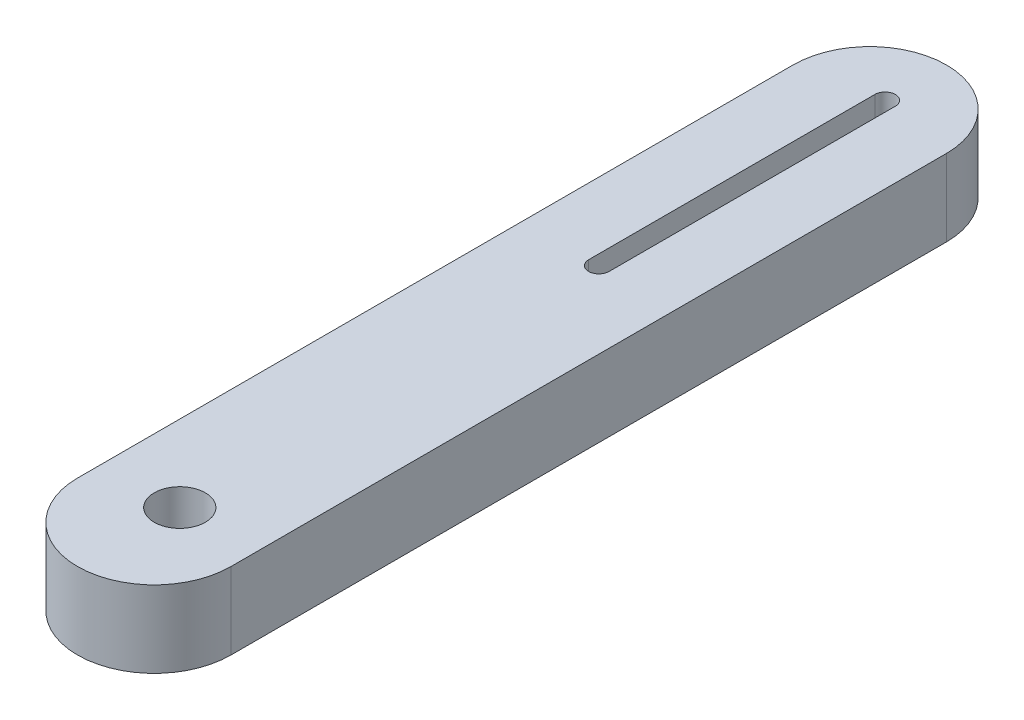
from build123d import *

# Parameters (mm, degrees)
BOSS_EXTRUDE1_DEPTH = 76.2
SKETCH2_W           = 38.1
SKETCH2_H           = 19.05
BOSS_EXTRUDE2_DEPTH = 127
SKETCH3_W           = 38.1
SKETCH3_H           = 19.05
BOSS_EXTRUDE3_DEPTH = 12.7
CUT_EXTRUDE1_DEPTH  = 205.978157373
SKETCH5_R           = 6.35
CUT_EXTRUDE2_DEPTH  = 205.978157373
SKETCH6_OUTSIDE_W   = 84.112
SKETCH6_OUTSIDE_H   = 261.912
CUT_EXTRUDE3_DEPTH  = 205.978157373


with BuildPart() as part:
    # Sketch1 → Boss-Extrude1 (new body)
    with BuildSketch(Plane.XY):
        Polygon((-19.05, -9.525), (-6.35, -9.525), (-6.35, 3.175), (6.35, 3.175), (6.35, -9.525), (19.05, -9.525), (19.05, 9.525), (-19.05, 9.525), align=None)
    extrude(amount=BOSS_EXTRUDE1_DEPTH)

    # Sketch2 → Boss-Extrude2 (add)
    with BuildSketch(Plane.XY.offset(76.2)):
        Rectangle(SKETCH2_W, SKETCH2_H)
    extrude(amount=BOSS_EXTRUDE2_DEPTH)

    # Sketch3 → Boss-Extrude3 (add)
    with BuildSketch(Plane(origin=(0, 0, 0), x_dir=(-1, 0, 0), z_dir=(0, 0, -1))):
        Rectangle(SKETCH3_W, SKETCH3_H)
    extrude(amount=BOSS_EXTRUDE3_DEPTH)

    # Sketch4 → Cut-Extrude1 (cut, through all)
    with BuildSketch(Plane(origin=(0, 9.525, 0), x_dir=(1, 0, 0), z_dir=(0, 1, 0))):
        with BuildLine():
            Line((2.54, -2.54), (2.54, -73.66))
            ThreePointArc((2.54, -73.66), (0, -76.2), (-2.54, -73.66))
            Line((-2.54, -73.66), (-2.54, -2.54))
            ThreePointArc((-2.54, -2.54), (0, 0), (2.54, -2.54))
        make_face()
    extrude(amount=-CUT_EXTRUDE1_DEPTH, mode=Mode.SUBTRACT)

    # Sketch5 → Cut-Extrude2 (cut, through all)
    with BuildSketch(Plane(origin=(0, 9.525, 0), x_dir=(1, 0, 0), z_dir=(0, 1, 0))):
        with Locations(Location((0, -177.8, 0), (0, 0, 180))):
            Circle(SKETCH5_R)
    extrude(amount=-CUT_EXTRUDE2_DEPTH, mode=Mode.SUBTRACT)

    # Sketch6 outside → Cut-Extrude3 (cut, through all)
    with BuildSketch(Plane(origin=(0, 9.525, 0), x_dir=(1, 0, 0), z_dir=(0, 1, 0))):
        with Locations((0, -95.25)):
            Rectangle(SKETCH6_OUTSIDE_W, SKETCH6_OUTSIDE_H)
        with BuildLine():
            Line((-19.05, -184.15), (-19.05, -6.35))
            ThreePointArc((-19.05, -6.35), (0, 12.7), (19.05, -6.35))
            Line((19.05, -6.35), (19.05, -184.15))
            ThreePointArc((19.05, -184.15), (0, -203.2), (-19.05, -184.15))
        make_face(mode=Mode.SUBTRACT)
    extrude(amount=-CUT_EXTRUDE3_DEPTH, mode=Mode.SUBTRACT)


solid = part.part
